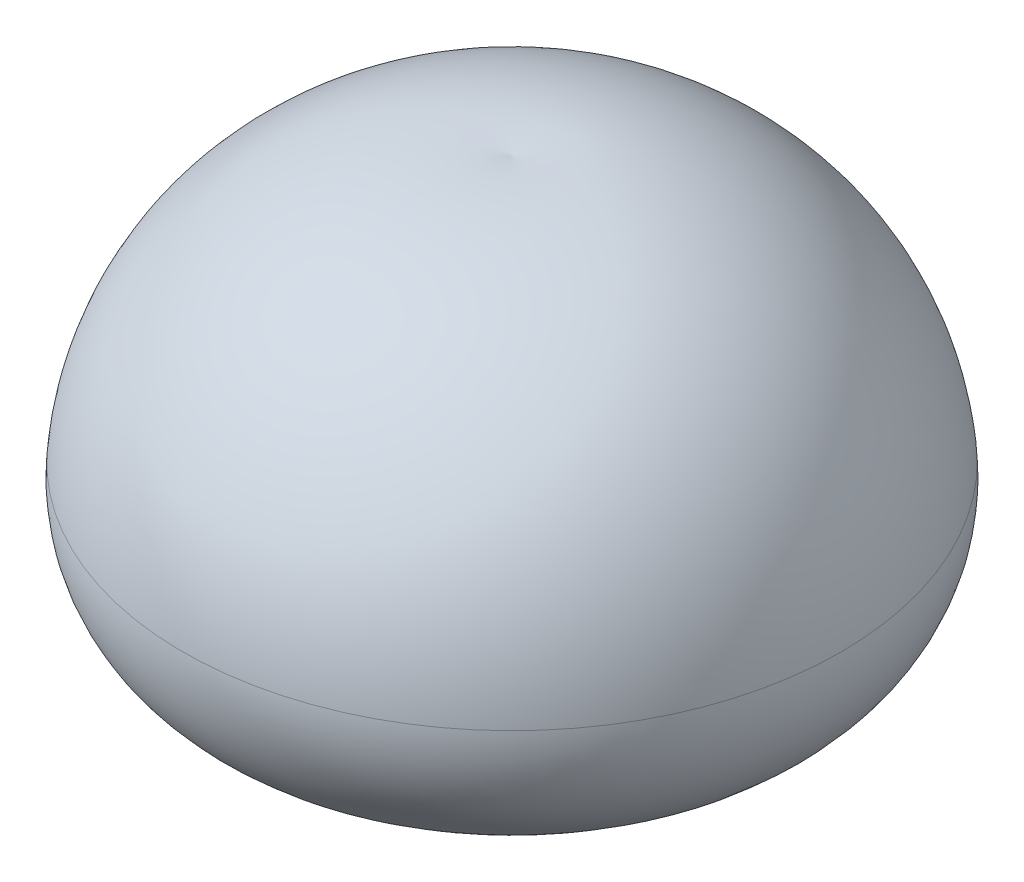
ISO-10303-21;
HEADER;
FILE_DESCRIPTION(('STEP AP214'),'2;1');
FILE_NAME('part.step','',(''),(''),'','','');
FILE_SCHEMA(('AUTOMOTIVE_DESIGN { 1 0 10303 214 1 1 1 1 }'));
ENDSEC;
DATA;
#1=APPLICATION_CONTEXT('core data for automotive mechanical design processes');
#2=APPLICATION_PROTOCOL_DEFINITION('international standard','automotive_design',2000,#1);
#3=PRODUCT_CONTEXT('',#1,'mechanical');
#4=PRODUCT('Part','Part','',(#3));
#5=PRODUCT_RELATED_PRODUCT_CATEGORY('part','',(#4));
#6=PRODUCT_DEFINITION_FORMATION('','',#4);
#7=PRODUCT_DEFINITION_CONTEXT('part definition',#1,'design');
#8=PRODUCT_DEFINITION('design','',#6,#7);
#9=PRODUCT_DEFINITION_SHAPE('','',#8);
#10=(LENGTH_UNIT() NAMED_UNIT(*) SI_UNIT(.MILLI.,.METRE.));
#11=(NAMED_UNIT(*) PLANE_ANGLE_UNIT() SI_UNIT($,.RADIAN.));
#12=(NAMED_UNIT(*) SI_UNIT($,.STERADIAN.) SOLID_ANGLE_UNIT());
#13=UNCERTAINTY_MEASURE_WITH_UNIT(LENGTH_MEASURE(1.E-05),#10,'distance_accuracy_value','');
#14=(GEOMETRIC_REPRESENTATION_CONTEXT(3) GLOBAL_UNCERTAINTY_ASSIGNED_CONTEXT((#13)) GLOBAL_UNIT_ASSIGNED_CONTEXT((#10,
#11,#12)) REPRESENTATION_CONTEXT('',''));
#15=CARTESIAN_POINT('',(0.,0.,0.));
#16=DIRECTION('',(0.,0.,1.));
#17=DIRECTION('',(1.,0.,0.));
#18=AXIS2_PLACEMENT_3D('',#15,#16,#17);
#19=CARTESIAN_POINT('',(-1.11022302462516E-13,1237.5,0.));
#20=DIRECTION('',(0.,-1.,0.));
#21=DIRECTION('',(1.,0.,0.));
#22=AXIS2_PLACEMENT_3D('',#19,#20,#21);
#23=DEGENERATE_TOROIDAL_SURFACE('',#22,726.240103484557,1226.41754716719,.F.);
#24=CARTESIAN_POINT('',(-1.85470888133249E-13,1011.59415073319,0.));
#25=DIRECTION('',(0.,-1.,0.));
#26=DIRECTION('',(1.,0.,0.));
#27=AXIS2_PLACEMENT_3D('',#24,#25,#26);
#28=CIRCLE('',#27,479.191996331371);
#29=CARTESIAN_POINT('',(479.19199633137,1011.59415073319,0.));
#30=VERTEX_POINT('',#29);
#31=EDGE_CURVE('E11',#30,#30,#28,.T.);
#32=ORIENTED_EDGE('',*,*,#31,.T.);
#33=EDGE_LOOP('',(#32));
#34=FACE_BOUND('',#33,.T.);
#35=CARTESIAN_POINT('',(-3.21809603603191E-11,1609.96951227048,0.));
#36=DIRECTION('',(0.,-1.,0.));
#37=DIRECTION('',(1.,0.,0.));
#38=AXIS2_PLACEMENT_3D('',#35,#36,#37);
#39=CIRCLE('',#38,442.248861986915);
#40=CARTESIAN_POINT('',(442.248861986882,1609.96951227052,0.));
#41=VERTEX_POINT('',#40);
#42=EDGE_CURVE('E39',#41,#41,#39,.F.);
#43=ORIENTED_EDGE('',*,*,#42,.T.);
#44=EDGE_LOOP('',(#43));
#45=FACE_BOUND('',#44,.T.);
#46=ADVANCED_FACE('F35',(#34,#45),#23,.T.);
#47=CARTESIAN_POINT('',(300.,645.,0.));
#48=DIRECTION('',(0.,0.,-1.));
#49=DIRECTION('',(1.,0.,0.));
#50=AXIS2_PLACEMENT_3D('',#47,#48,#49);
#51=CIRCLE('',#50,2411.41754716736);
#52=TRIMMED_CURVE('',#51,(PARAMETER_VALUE(-1.69552765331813)),
(PARAMETER_VALUE(1.69552765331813)),.T.,.PARAMETER.);
#53=CARTESIAN_POINT('',(-2.22044604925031E-13,645.,0.));
#54=DIRECTION('',(0.,-1.,0.));
#55=AXIS1_PLACEMENT('',#53,#54);
#56=SURFACE_OF_REVOLUTION('',#52,#55);
#57=CARTESIAN_POINT('',(5.56147093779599E-13,3037.68355341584,0.));
#58=VERTEX_POINT('',#57);
#59=VERTEX_LOOP('',#58);
#60=FACE_BOUND('',#59,.T.);
#61=CARTESIAN_POINT('',(-1.9979026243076E-13,855.168887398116,0.));
#62=DIRECTION('',(0.,-1.,0.));
#63=DIRECTION('',(1.,0.,0.));
#64=AXIS2_PLACEMENT_3D('',#61,#62,#63);
#65=CIRCLE('',#64,2702.24137537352);
#66=CARTESIAN_POINT('',(2702.24137537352,855.168887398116,0.));
#67=VERTEX_POINT('',#66);
#68=EDGE_CURVE('E78',#67,#67,#65,.T.);
#69=ORIENTED_EDGE('',*,*,#68,.F.);
#70=EDGE_LOOP('',(#69));
#71=FACE_BOUND('',#70,.T.);
#72=ADVANCED_FACE('F37',(#60,#71),#56,.T.);
#73=CARTESIAN_POINT('',(-2.22044604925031E-13,645.,0.));
#74=DIRECTION('',(0.,-1.,0.));
#75=DIRECTION('',(1.,0.,0.));
#76=AXIS2_PLACEMENT_3D('',#73,#74,#75);
#77=DEGENERATE_TOROIDAL_SURFACE('',#76,300.,408.045393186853,.T.);
#78=CARTESIAN_POINT('',(-2.5592756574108E-13,241.923345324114,0.));
#79=DIRECTION('',(0.,-1.,0.));
#80=DIRECTION('',(1.,0.,0.));
#81=AXIS2_PLACEMENT_3D('',#78,#79,#80);
#82=CIRCLE('',#81,363.48427644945);
#83=CARTESIAN_POINT('',(363.484276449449,241.923345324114,0.));
#84=VERTEX_POINT('',#83);
#85=EDGE_CURVE('E44',#84,#84,#82,.T.);
#86=ORIENTED_EDGE('',*,*,#85,.T.);
#87=EDGE_LOOP('',(#86));
#88=FACE_BOUND('',#87,.T.);
#89=ORIENTED_EDGE('',*,*,#31,.F.);
#90=EDGE_LOOP('',(#89));
#91=FACE_BOUND('',#90,.T.);
#92=ADVANCED_FACE('F58',(#88,#91),#77,.F.);
#93=CARTESIAN_POINT('',(0.,748.279555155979,0.));
#94=DIRECTION('',(0.,-1.,0.));
#95=DIRECTION('',(1.,0.,0.));
#96=AXIS2_PLACEMENT_3D('',#93,#94,#95);
#97=TOROIDAL_SURFACE('',#96,1480.49071723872,1226.41754716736);
#98=ORIENTED_EDGE('',*,*,#68,.T.);
#99=EDGE_LOOP('',(#98));
#100=FACE_BOUND('',#99,.T.);
#101=ORIENTED_EDGE('',*,*,#85,.F.);
#102=EDGE_LOOP('',(#101));
#103=FACE_BOUND('',#102,.T.);
#104=ADVANCED_FACE('F52',(#100,#103),#97,.T.);
#105=CARTESIAN_POINT('',(-300.000000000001,645.,0.));
#106=DIRECTION('',(0.,0.,-1.));
#107=DIRECTION('',(1.,0.,0.));
#108=AXIS2_PLACEMENT_3D('',#105,#106,#107);
#109=CIRCLE('',#108,1217.41510288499);
#110=TRIMMED_CURVE('',#109,(PARAMETER_VALUE(-1.32180785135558)),
(PARAMETER_VALUE(1.32180785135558)),.T.,.PARAMETER.);
#111=CARTESIAN_POINT('',(5.09037256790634E-11,645.,0.));
#112=DIRECTION('',(0.,-1.,0.));
#113=AXIS1_PLACEMENT('',#111,#112);
#114=SURFACE_OF_REVOLUTION('',#110,#113);
#115=ORIENTED_EDGE('',*,*,#42,.F.);
#116=EDGE_LOOP('',(#115));
#117=FACE_BOUND('',#116,.T.);
#118=CARTESIAN_POINT('',(-5.16222530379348E-11,1824.87267649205,0.));
#119=VERTEX_POINT('',#118);
#120=VERTEX_LOOP('',#119);
#121=FACE_BOUND('',#120,.T.);
#122=ADVANCED_FACE('F50',(#117,#121),#114,.F.);
#123=CLOSED_SHELL('',(#46,#72,#92,#104,#122));
#124=MANIFOLD_SOLID_BREP('B2',#123);
#125=ADVANCED_BREP_SHAPE_REPRESENTATION('',(#18,#124),#14);
#126=SHAPE_DEFINITION_REPRESENTATION(#9,#125);
ENDSEC;
END-ISO-10303-21;
